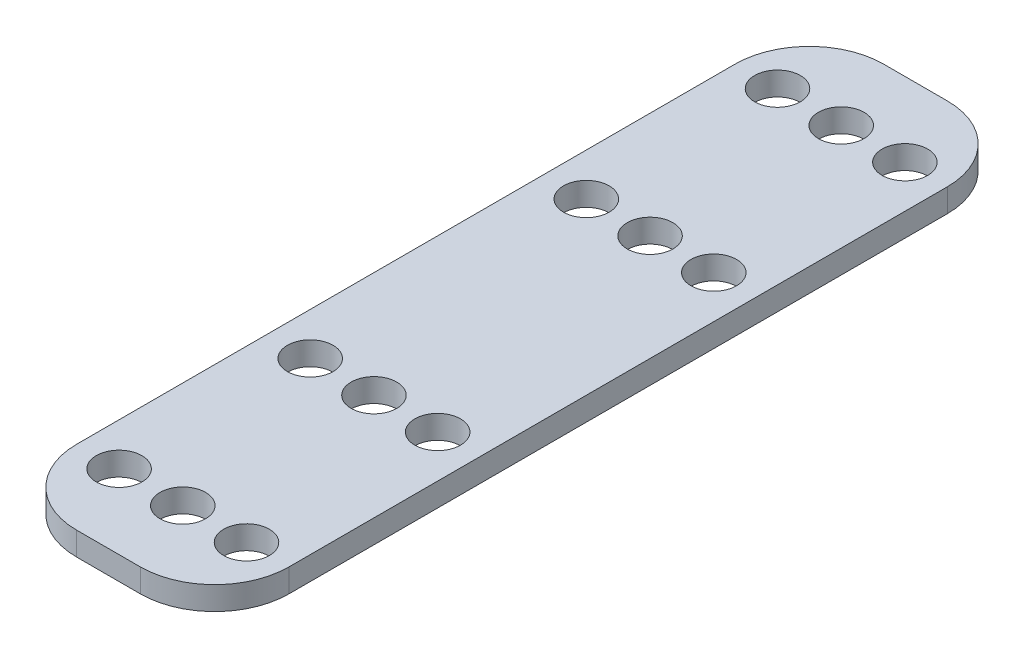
from build123d import *

# Parameters (mm, degrees)
SKETCH1_R           = 2.15
BOSS_EXTRUDE1_DEPTH = 2.2


with BuildPart() as part:
    # Sketch1 → Boss-Extrude1 (new body)
    with BuildSketch(Plane(origin=(0, 0, 0), x_dir=(1, 0, 0), z_dir=(0, 1, 0))):
        with BuildLine():
            Line((7, 0), (13, 0))
            ThreePointArc((13, 0), (17.949747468, 2.050252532), (20, 7))
            Line((20, 7), (20, 69))
            ThreePointArc((20, 69), (17.949747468, 73.949747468), (13, 76))
            Line((13, 76), (7, 76))
            ThreePointArc((7, 76), (2.050252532, 73.949747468), (0, 69))
            Line((0, 69), (0, 7))
            ThreePointArc((0, 7), (2.050252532, 2.050252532), (7, 0))
        make_face()
        with Locations(Location((4, 69, 0), (0, 0, 270))):
            Circle(SKETCH1_R, mode=Mode.SUBTRACT)
        with Locations(Location((10, 69, 0), (0, 0, 270))):
            Circle(SKETCH1_R, mode=Mode.SUBTRACT)
        with Locations(Location((16, 69, 0), (0, 0, 270))):
            Circle(SKETCH1_R, mode=Mode.SUBTRACT)
        with Locations(Location((10, 51, 0), (0, 0, 270))):
            Circle(SKETCH1_R, mode=Mode.SUBTRACT)
        with Locations(Location((16, 51, 0), (0, 0, 270))):
            Circle(SKETCH1_R, mode=Mode.SUBTRACT)
        with Locations(Location((4, 51, 0), (0, 0, 270))):
            Circle(SKETCH1_R, mode=Mode.SUBTRACT)
        with Locations(Location((16, 7, 0), (0, 0, 90))):
            Circle(SKETCH1_R, mode=Mode.SUBTRACT)
        with Locations(Location((10, 7, 0), (0, 0, 90))):
            Circle(SKETCH1_R, mode=Mode.SUBTRACT)
        with Locations(Location((4, 7, 0), (0, 0, 90))):
            Circle(SKETCH1_R, mode=Mode.SUBTRACT)
        with Locations(Location((4, 25, 0), (0, 0, 90))):
            Circle(SKETCH1_R, mode=Mode.SUBTRACT)
        with Locations(Location((10, 25, 0), (0, 0, 90))):
            Circle(SKETCH1_R, mode=Mode.SUBTRACT)
        with Locations(Location((16, 25, 0), (0, 0, 90))):
            Circle(SKETCH1_R, mode=Mode.SUBTRACT)
    extrude(amount=BOSS_EXTRUDE1_DEPTH)


solid = part.part
